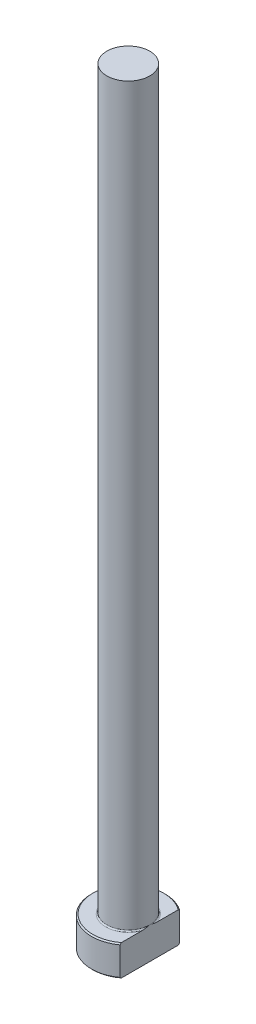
from build123d import *
from build123d.topology import SkipClean

# Parameters (mm, degrees)
CHAMFER1_SIZE = 0.2
FILLET1_R     = 0.2
KEY_DEPTH     = 126.287668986


with BuildPart() as part:
    # Sketch1 → Revolve1 (revolve)
    with BuildSketch(Plane.XY, mode=Mode.PRIVATE) as revolve1_sk:
        Polygon((0, 0), (-6, 0), (-6, 5), (-3.5, 5), (-3.5, 125), (0, 125), align=None)
    revolve(revolve1_sk.sketch.rotate(Axis((0, 259.958771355, 0), (0, -1, 0)), 270), axis=Axis((0, 259.958771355, 0), (0, -1, 0)))

    # Chamfer1
    chamfer1_edges = [part.edges().sort_by_distance(p)[0] for p in [
        (0, 5, -6),
        (0, 0, -6),
    ]]
    chamfer(chamfer1_edges, length=CHAMFER1_SIZE)

    # Fillet1
    fillet1_edges = [part.edges().sort_by_distance(p)[0] for p in [
        (0, 5, -3.5),
    ]]
    fillet(fillet1_edges, radius=FILLET1_R)

    # Sketch2 → KEY (cut, through all)
    with SkipClean():  # the faces are left unmerged after this step: merging them gives an invalid solid
        with BuildSketch(Plane(origin=(0, 0, 0), x_dir=(1, 0, 0), z_dir=(0, 1, 0))):
            with BuildLine():
                Line((3.5, 4.873397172), (3.5, -4.873397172))
                ThreePointArc((3.5, -4.873397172), (6, 0), (3.5, 4.873397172))
            make_face()
        extrude(amount=KEY_DEPTH, mode=Mode.SUBTRACT)


solid = part.part
